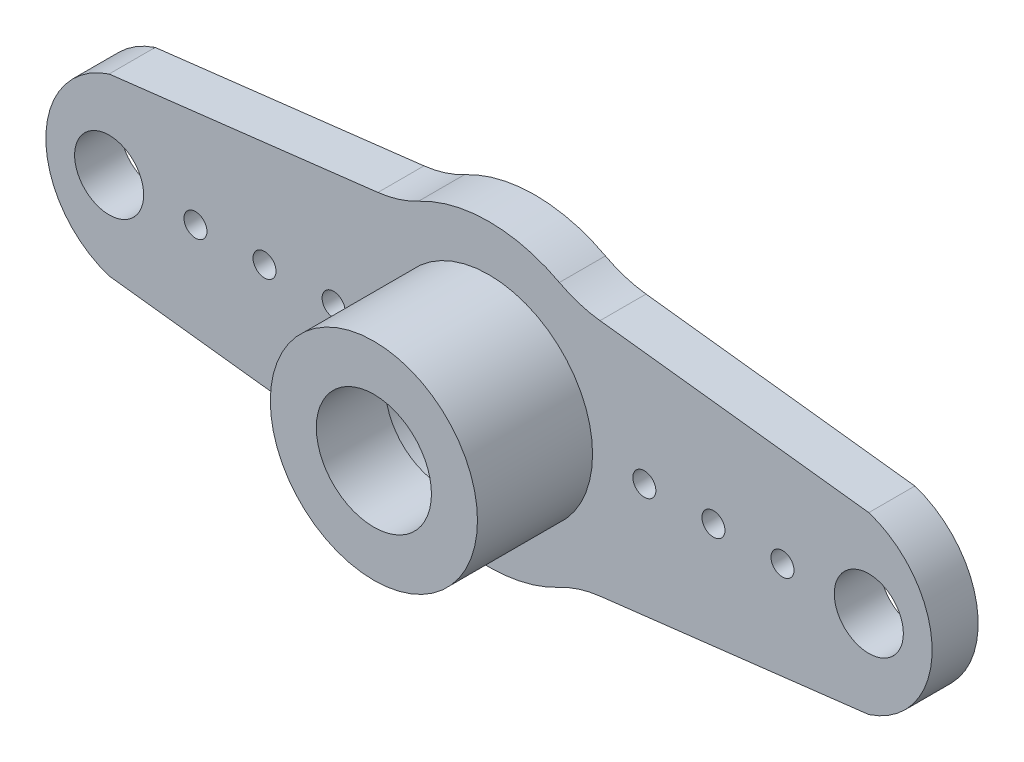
from build123d import *

# Parameters (mm, degrees)
SKETCH_1_R          = 0.5
EXTRUDE_1_DEPTH     = 2
SKETCH_2_R          = 4.5
SKETCH_2_R_2        = 2.5
EXTRUDE_2_DEPTH     = 5
SKETCH_3_R          = 3.5
CUT_EXTRUDE_1_DEPTH = 4
SKETCH_5_R          = 1.5
CUT_EXTRUDE_2_DEPTH = 10


with BuildPart() as part:
    # Sketch 1 → Extrude 1 (new body)
    with BuildSketch(Plane.XY):
        with BuildLine():
            Line((16.5, -3.799671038), (4.823155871, -5.182135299))
            ThreePointArc((4.823155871, -5.182135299), (3.914969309, -5.376520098), (3.058401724, -5.735519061))
            ThreePointArc((3.058401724, -5.735519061), (0, -6.5), (-3.058401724, -5.735519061))
            ThreePointArc((-3.058401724, -5.735519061), (-3.914969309, -5.376520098), (-4.823155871, -5.182135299))
            Line((-4.823155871, -5.182135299), (-16.5, -3.799671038))
            ThreePointArc((-16.5, -3.799671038), (-19.25, 0), (-16.5, 3.799671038))
            Line((-16.5, 3.799671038), (-4.823155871, 5.182135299))
            ThreePointArc((-4.823155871, 5.182135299), (-3.914969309, 5.376520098), (-3.058401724, 5.735519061))
            ThreePointArc((-3.058401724, 5.735519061), (0, 6.5), (3.058401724, 5.735519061))
            ThreePointArc((3.058401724, 5.735519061), (3.914969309, 5.376520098), (4.823155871, 5.182135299))
            Line((4.823155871, 5.182135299), (16.5, 3.799671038))
            ThreePointArc((16.5, 3.799671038), (19.25, 0), (16.5, -3.799671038))
        make_face()
        with Locations((-16.5, 0)):
            Circle(SKETCH_1_R, mode=Mode.SUBTRACT)
        with Locations((-12.75, 0)):
            Circle(SKETCH_1_R, mode=Mode.SUBTRACT)
        with Locations((-9.75, 0)):
            Circle(SKETCH_1_R, mode=Mode.SUBTRACT)
        with Locations((-6.75, 0)):
            Circle(SKETCH_1_R, mode=Mode.SUBTRACT)
        with Locations((-3.75, 0)):
            Circle(SKETCH_1_R, mode=Mode.SUBTRACT)
        with Locations(Location((3.75, 0, 0), (0, 0, 180))):
            Circle(SKETCH_1_R, mode=Mode.SUBTRACT)
        with Locations(Location((6.75, 0, 0), (0, 0, 180))):
            Circle(SKETCH_1_R, mode=Mode.SUBTRACT)
        with Locations(Location((9.75, 0, 0), (0, 0, 180))):
            Circle(SKETCH_1_R, mode=Mode.SUBTRACT)
        with Locations(Location((12.75, 0, 0), (0, 0, 180))):
            Circle(SKETCH_1_R, mode=Mode.SUBTRACT)
        with Locations(Location((16.5, 0, 0), (0, 0, 180))):
            Circle(SKETCH_1_R, mode=Mode.SUBTRACT)
    extrude(amount=EXTRUDE_1_DEPTH)

    # Sketch 2 → Extrude 2 (add)
    with BuildSketch(Plane.XY.offset(2)):
        Circle(SKETCH_2_R)
        Circle(SKETCH_2_R_2, mode=Mode.SUBTRACT)
    extrude(amount=EXTRUDE_2_DEPTH)

    # Sketch 3 → Cut-Extrude 1 (cut)
    with BuildSketch(Plane(origin=(0, 0, 0), x_dir=(-1, 0, 0), z_dir=(0, 0, -1))):
        Circle(SKETCH_3_R)
    extrude(amount=-CUT_EXTRUDE_1_DEPTH, mode=Mode.SUBTRACT)

    # Sketch 5 → Cut-Extrude 2 (cut)
    with BuildSketch(Plane.XY.offset(2)):
        with Locations((16.5, 0)):
            Circle(SKETCH_5_R)
        with Locations((-16.5, 0)):
            Circle(SKETCH_5_R)
    extrude(amount=-CUT_EXTRUDE_2_DEPTH, mode=Mode.SUBTRACT)


solid = part.part
